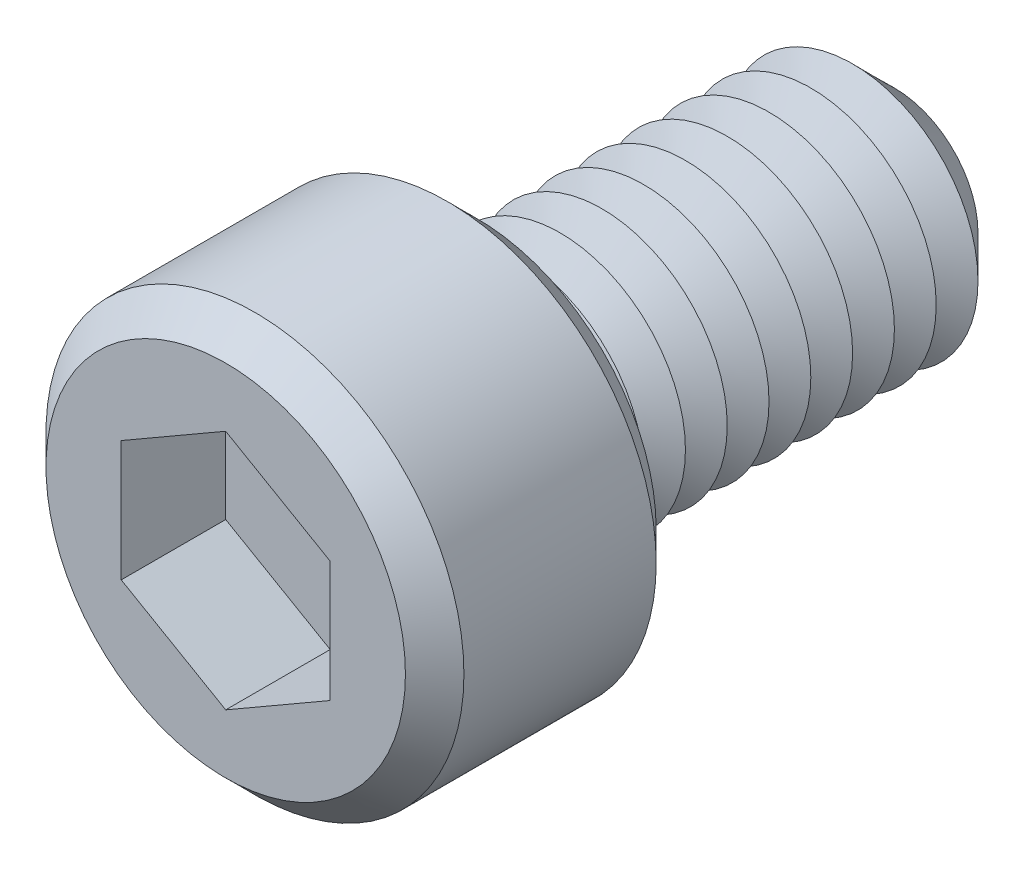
from build123d import *

# Parameters (mm, degrees)
SKETCH1_R           = 5
BOSS_EXTRUDE1_DEPTH = 6
SKETCH2_R           = 3
BOSS_EXTRUDE2_DEPTH = 10
CHAMFER1_SIZE       = 1
LPATTERN1_COUNT     = 9
LPATTERN1_PITCH     = 1
CUT_EXTRUDE1_DEPTH  = 2.5
SKETCH6_R           = 0.8
CUT_EXTRUDE2_DEPTH  = 13.5
CHAMFER2_SIZE       = 0.7


with BuildPart() as part:
    # Sketch1 → Boss-Extrude1 (new body)
    with BuildSketch(Plane.XY):
        Circle(SKETCH1_R)
    extrude(amount=BOSS_EXTRUDE1_DEPTH)

    # Sketch2 → Boss-Extrude2 (add)
    with BuildSketch(Plane(origin=(0, 0, 0), x_dir=(-1, 0, 0), z_dir=(0, 0, -1))):
        Circle(SKETCH2_R)
    extrude(amount=BOSS_EXTRUDE2_DEPTH)

    # Chamfer1
    chamfer1_edges = [part.edges().sort_by_distance(p)[0] for p in [
        (3, 0, -10),
    ]]
    chamfer(chamfer1_edges, length=CHAMFER1_SIZE)

    # Sketch4 → Cut-Revolve1 (revolve, cut)
    with BuildSketch(Plane(origin=(0, 0, 0), x_dir=(0, 0, -1), z_dir=(1, 0, 0)), mode=Mode.PRIVATE) as cut_revolve1_sk:
        Polygon((0, 3), (0.5, 2.133974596), (1, 3), align=None)
    cut_revolve1 = revolve(cut_revolve1_sk.sketch.rotate(Axis((0, 0, 2.512122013), (0, 0, -1)), 90), axis=Axis((0, 0, 2.512122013), (0, 0, -1)), mode=Mode.SUBTRACT)

    # LPattern1: Cut-Revolve1 ×9
    with Locations(*[(0, 0, -i * LPATTERN1_PITCH) for i in range(1, LPATTERN1_COUNT)]):
        add(cut_revolve1, mode=Mode.SUBTRACT)

    # Sketch5 → Cut-Extrude1 (cut)
    with BuildSketch(Plane.XY.offset(6)):
        Polygon((0, 2.886751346), (-2.5, 1.443375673), (-2.5, -1.443375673), (0, -2.886751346), (2.5, -1.443375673), (2.5, 1.443375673), align=None)
    extrude(amount=-CUT_EXTRUDE1_DEPTH, mode=Mode.SUBTRACT)

    # Sketch6 → Cut-Extrude2 (cut)
    with BuildSketch(Plane.XY.offset(3.5)):
        Circle(SKETCH6_R)
    extrude(amount=-CUT_EXTRUDE2_DEPTH, mode=Mode.SUBTRACT)

    # Chamfer2
    chamfer2_edges = [part.edges().sort_by_distance(p)[0] for p in [
        (-5, 0, 0),
        (-5, 0, 6),
    ]]
    chamfer(chamfer2_edges, length=CHAMFER2_SIZE)


solid = part.part
